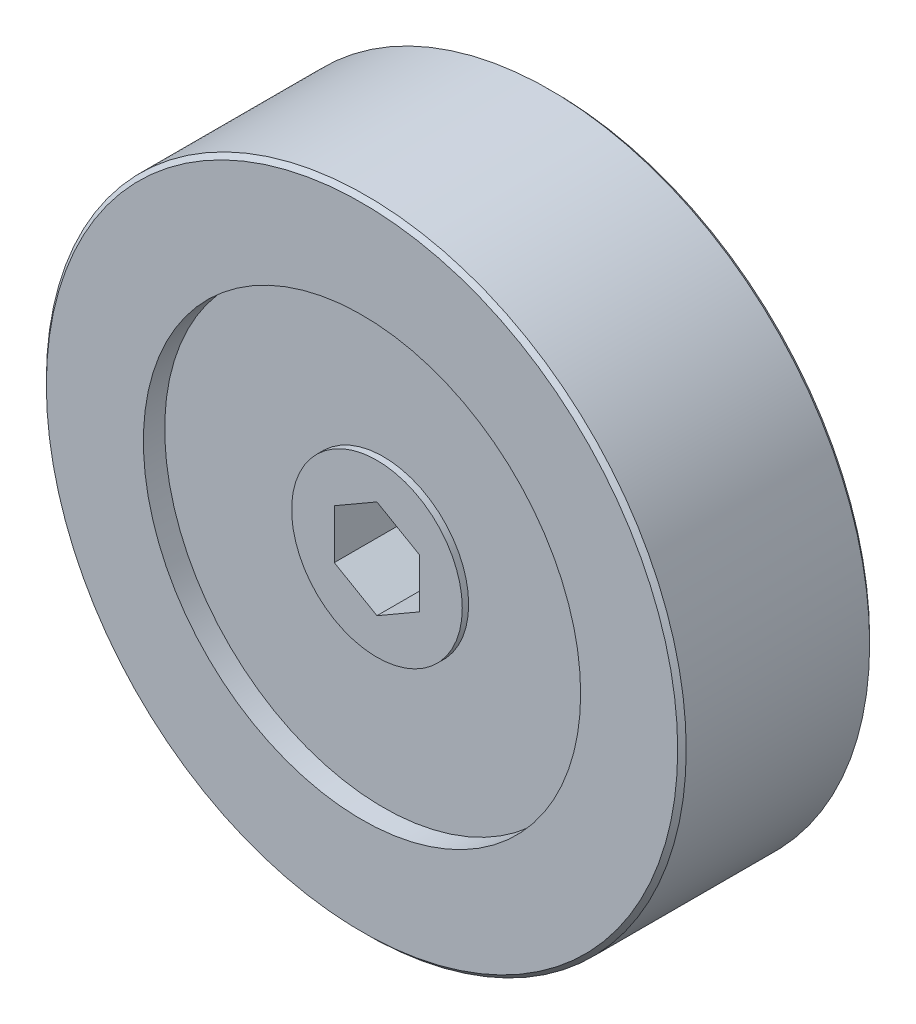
ISO-10303-21;
HEADER;
FILE_DESCRIPTION(('STEP AP214'),'2;1');
FILE_NAME('part.step','',(''),(''),'','','');
FILE_SCHEMA(('AUTOMOTIVE_DESIGN { 1 0 10303 214 1 1 1 1 }'));
ENDSEC;
DATA;
#1=APPLICATION_CONTEXT('core data for automotive mechanical design processes');
#2=APPLICATION_PROTOCOL_DEFINITION('international standard','automotive_design',2000,#1);
#3=PRODUCT_CONTEXT('',#1,'mechanical');
#4=PRODUCT('Part','Part','',(#3));
#5=PRODUCT_RELATED_PRODUCT_CATEGORY('part','',(#4));
#6=PRODUCT_DEFINITION_FORMATION('','',#4);
#7=PRODUCT_DEFINITION_CONTEXT('part definition',#1,'design');
#8=PRODUCT_DEFINITION('design','',#6,#7);
#9=PRODUCT_DEFINITION_SHAPE('','',#8);
#10=(LENGTH_UNIT() NAMED_UNIT(*) SI_UNIT(.MILLI.,.METRE.));
#11=(NAMED_UNIT(*) PLANE_ANGLE_UNIT() SI_UNIT($,.RADIAN.));
#12=(NAMED_UNIT(*) SI_UNIT($,.STERADIAN.) SOLID_ANGLE_UNIT());
#13=UNCERTAINTY_MEASURE_WITH_UNIT(LENGTH_MEASURE(1.E-05),#10,'distance_accuracy_value','');
#14=(GEOMETRIC_REPRESENTATION_CONTEXT(3) GLOBAL_UNCERTAINTY_ASSIGNED_CONTEXT((#13)) GLOBAL_UNIT_ASSIGNED_CONTEXT((#10,
#11,#12)) REPRESENTATION_CONTEXT('',''));
#15=CARTESIAN_POINT('',(0.,0.,0.));
#16=DIRECTION('',(0.,0.,1.));
#17=DIRECTION('',(1.,0.,0.));
#18=AXIS2_PLACEMENT_3D('',#15,#16,#17);
#19=CARTESIAN_POINT('',(0.,0.,1.2));
#20=DIRECTION('',(0.,0.,-1.));
#21=DIRECTION('',(-1.,0.,0.));
#22=AXIS2_PLACEMENT_3D('',#19,#20,#21);
#23=CYLINDRICAL_SURFACE('',#22,2.5);
#24=CARTESIAN_POINT('',(0.,0.,-7.1));
#25=DIRECTION('',(0.,0.,-1.));
#26=DIRECTION('',(-1.,0.,0.));
#27=AXIS2_PLACEMENT_3D('',#24,#25,#26);
#28=CIRCLE('',#27,2.5);
#29=CARTESIAN_POINT('',(-2.5,0.,-7.1));
#30=VERTEX_POINT('',#29);
#31=EDGE_CURVE('E9',#30,#30,#28,.F.);
#32=ORIENTED_EDGE('',*,*,#31,.T.);
#33=EDGE_LOOP('',(#32));
#34=FACE_BOUND('',#33,.T.);
#35=CARTESIAN_POINT('',(0.,0.,-1.1));
#36=DIRECTION('',(0.,0.,1.));
#37=DIRECTION('',(1.,0.,0.));
#38=AXIS2_PLACEMENT_3D('',#35,#36,#37);
#39=CIRCLE('',#38,2.5);
#40=CARTESIAN_POINT('',(2.5,0.,-1.1));
#41=VERTEX_POINT('',#40);
#42=EDGE_CURVE('E76',#41,#41,#39,.T.);
#43=ORIENTED_EDGE('',*,*,#42,.F.);
#44=EDGE_LOOP('',(#43));
#45=FACE_BOUND('',#44,.T.);
#46=ADVANCED_FACE('F14',(#34,#45),#23,.T.);
#47=CARTESIAN_POINT('',(0.,0.,1.2));
#48=DIRECTION('',(0.,0.,-1.));
#49=DIRECTION('',(-1.,0.,0.));
#50=AXIS2_PLACEMENT_3D('',#47,#48,#49);
#51=CYLINDRICAL_SURFACE('',#50,5.);
#52=CARTESIAN_POINT('',(0.,0.,2.));
#53=DIRECTION('',(0.,0.,-1.));
#54=DIRECTION('',(-1.,0.,0.));
#55=AXIS2_PLACEMENT_3D('',#52,#53,#54);
#56=CIRCLE('',#55,5.);
#57=CARTESIAN_POINT('',(-5.,0.,2.));
#58=VERTEX_POINT('',#57);
#59=EDGE_CURVE('E113',#58,#58,#56,.F.);
#60=ORIENTED_EDGE('',*,*,#59,.F.);
#61=EDGE_LOOP('',(#60));
#62=FACE_BOUND('',#61,.T.);
#63=CARTESIAN_POINT('',(0.,0.,0.5));
#64=DIRECTION('',(0.,0.,-1.));
#65=DIRECTION('',(-1.,0.,0.));
#66=AXIS2_PLACEMENT_3D('',#63,#64,#65);
#67=CIRCLE('',#66,5.);
#68=CARTESIAN_POINT('',(-5.,0.,0.5));
#69=VERTEX_POINT('',#68);
#70=EDGE_CURVE('E110',#69,#69,#67,.T.);
#71=ORIENTED_EDGE('',*,*,#70,.F.);
#72=EDGE_LOOP('',(#71));
#73=FACE_BOUND('',#72,.T.);
#74=ADVANCED_FACE('F155',(#62,#73),#51,.T.);
#75=CARTESIAN_POINT('',(0.,5.1,2.));
#76=DIRECTION('',(0.,0.,-1.));
#77=DIRECTION('',(-1.,0.,0.));
#78=AXIS2_PLACEMENT_3D('',#75,#76,#77);
#79=PLANE('',#78);
#80=CARTESIAN_POINT('',(0.,0.,2.));
#81=DIRECTION('',(0.,0.,1.));
#82=DIRECTION('',(1.,0.,0.));
#83=AXIS2_PLACEMENT_3D('',#80,#81,#82);
#84=CIRCLE('',#83,10.25);
#85=CARTESIAN_POINT('',(10.25,0.,2.));
#86=VERTEX_POINT('',#85);
#87=EDGE_CURVE('E128',#86,#86,#84,.T.);
#88=ORIENTED_EDGE('',*,*,#87,.F.);
#89=EDGE_LOOP('',(#88));
#90=FACE_BOUND('',#89,.T.);
#91=ORIENTED_EDGE('',*,*,#59,.T.);
#92=EDGE_LOOP('',(#91));
#93=FACE_BOUND('',#92,.T.);
#94=ADVANCED_FACE('F161',(#90,#93),#79,.T.);
#95=CARTESIAN_POINT('',(0.,0.,13.));
#96=DIRECTION('',(0.,0.,1.));
#97=DIRECTION('',(1.,0.,0.));
#98=AXIS2_PLACEMENT_3D('',#95,#96,#97);
#99=CYLINDRICAL_SURFACE('',#98,10.25);
#100=ORIENTED_EDGE('',*,*,#87,.T.);
#101=EDGE_LOOP('',(#100));
#102=FACE_BOUND('',#101,.T.);
#103=CARTESIAN_POINT('',(0.,0.,1.));
#104=DIRECTION('',(0.,0.,1.));
#105=DIRECTION('',(1.,0.,0.));
#106=AXIS2_PLACEMENT_3D('',#103,#104,#105);
#107=CIRCLE('',#106,10.25);
#108=CARTESIAN_POINT('',(10.25,0.,1.));
#109=VERTEX_POINT('',#108);
#110=EDGE_CURVE('E131',#109,#109,#107,.T.);
#111=ORIENTED_EDGE('',*,*,#110,.F.);
#112=EDGE_LOOP('',(#111));
#113=FACE_BOUND('',#112,.T.);
#114=ADVANCED_FACE('F196',(#102,#113),#99,.F.);
#115=CARTESIAN_POINT('',(0.,14.8,1.));
#116=DIRECTION('',(0.,0.,-1.));
#117=DIRECTION('',(-1.,0.,0.));
#118=AXIS2_PLACEMENT_3D('',#115,#116,#117);
#119=PLANE('',#118);
#120=ORIENTED_EDGE('',*,*,#110,.T.);
#121=EDGE_LOOP('',(#120));
#122=FACE_BOUND('',#121,.T.);
#123=CARTESIAN_POINT('',(0.,0.,1.));
#124=DIRECTION('',(0.,0.,1.));
#125=DIRECTION('',(1.,0.,0.));
#126=AXIS2_PLACEMENT_3D('',#123,#124,#125);
#127=CIRCLE('',#126,14.8);
#128=CARTESIAN_POINT('',(14.8,0.,1.));
#129=VERTEX_POINT('',#128);
#130=EDGE_CURVE('E436',#129,#129,#127,.T.);
#131=ORIENTED_EDGE('',*,*,#130,.F.);
#132=EDGE_LOOP('',(#131));
#133=FACE_BOUND('',#132,.T.);
#134=ADVANCED_FACE('F200',(#122,#133),#119,.T.);
#135=CARTESIAN_POINT('',(0.,0.,0.5));
#136=DIRECTION('',(0.,0.,-1.));
#137=DIRECTION('',(-1.,0.,0.));
#138=AXIS2_PLACEMENT_3D('',#135,#136,#137);
#139=PLANE('',#138);
#140=CARTESIAN_POINT('',(0.,0.,0.5));
#141=DIRECTION('',(0.,0.,-1.));
#142=DIRECTION('',(-1.,0.,0.));
#143=AXIS2_PLACEMENT_3D('',#140,#141,#142);
#144=CIRCLE('',#143,2.);
#145=CARTESIAN_POINT('',(-2.,0.,0.5));
#146=VERTEX_POINT('',#145);
#147=EDGE_CURVE('E107',#146,#146,#144,.T.);
#148=ORIENTED_EDGE('',*,*,#147,.F.);
#149=EDGE_LOOP('',(#148));
#150=FACE_BOUND('',#149,.T.);
#151=ORIENTED_EDGE('',*,*,#70,.T.);
#152=EDGE_LOOP('',(#151));
#153=FACE_BOUND('',#152,.T.);
#154=ADVANCED_FACE('F170',(#150,#153),#139,.T.);
#155=CARTESIAN_POINT('',(0.,0.,1.2));
#156=DIRECTION('',(0.,0.,-1.));
#157=DIRECTION('',(-1.,0.,0.));
#158=AXIS2_PLACEMENT_3D('',#155,#156,#157);
#159=CYLINDRICAL_SURFACE('',#158,2.);
#160=CARTESIAN_POINT('',(0.,0.,-1.1));
#161=DIRECTION('',(0.,0.,1.));
#162=DIRECTION('',(1.,0.,0.));
#163=AXIS2_PLACEMENT_3D('',#160,#161,#162);
#164=CIRCLE('',#163,2.);
#165=CARTESIAN_POINT('',(2.,0.,-1.1));
#166=VERTEX_POINT('',#165);
#167=EDGE_CURVE('E106',#166,#166,#164,.T.);
#168=ORIENTED_EDGE('',*,*,#167,.T.);
#169=EDGE_LOOP('',(#168));
#170=FACE_BOUND('',#169,.T.);
#171=ORIENTED_EDGE('',*,*,#147,.T.);
#172=EDGE_LOOP('',(#171));
#173=FACE_BOUND('',#172,.T.);
#174=ADVANCED_FACE('F167',(#170,#173),#159,.T.);
#175=CARTESIAN_POINT('',(0.,0.,-1.1));
#176=DIRECTION('',(0.,0.,1.));
#177=DIRECTION('',(1.,0.,0.));
#178=AXIS2_PLACEMENT_3D('',#175,#176,#177);
#179=PLANE('',#178);
#180=ORIENTED_EDGE('',*,*,#167,.F.);
#181=EDGE_LOOP('',(#180));
#182=FACE_BOUND('',#181,.T.);
#183=ORIENTED_EDGE('',*,*,#42,.T.);
#184=EDGE_LOOP('',(#183));
#185=FACE_BOUND('',#184,.T.);
#186=ADVANCED_FACE('F151',(#182,#185),#179,.T.);
#187=CARTESIAN_POINT('',(0.,0.,-7.5));
#188=DIRECTION('',(0.,0.,-1.));
#189=DIRECTION('',(-1.,0.,0.));
#190=AXIS2_PLACEMENT_3D('',#187,#188,#189);
#191=PLANE('',#190);
#192=CARTESIAN_POINT('',(0.,0.,-7.5));
#193=DIRECTION('',(0.,0.,-1.));
#194=DIRECTION('',(-1.,0.,0.));
#195=AXIS2_PLACEMENT_3D('',#192,#193,#194);
#196=CIRCLE('',#195,2.1);
#197=CARTESIAN_POINT('',(-2.1,0.,-7.5));
#198=VERTEX_POINT('',#197);
#199=EDGE_CURVE('E22',#198,#198,#196,.T.);
#200=ORIENTED_EDGE('',*,*,#199,.T.);
#201=EDGE_LOOP('',(#200));
#202=FACE_BOUND('',#201,.T.);
#203=ADVANCED_FACE('F138',(#202),#191,.T.);
#204=CARTESIAN_POINT('',(0.,0.,-7.5));
#205=DIRECTION('',(0.,0.,1.));
#206=DIRECTION('',(1.,0.,0.));
#207=AXIS2_PLACEMENT_3D('',#204,#205,#206);
#208=CONICAL_SURFACE('',#207,2.1,0.785398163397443);
#209=ORIENTED_EDGE('',*,*,#31,.F.);
#210=EDGE_LOOP('',(#209));
#211=FACE_BOUND('',#210,.T.);
#212=ORIENTED_EDGE('',*,*,#199,.F.);
#213=EDGE_LOOP('',(#212));
#214=FACE_BOUND('',#213,.T.);
#215=ADVANCED_FACE('F16',(#211,#214),#208,.T.);
#216=CARTESIAN_POINT('',(0.,0.,9.79999999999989));
#217=DIRECTION('',(0.,0.,-1.));
#218=DIRECTION('',(-1.,0.,0.));
#219=AXIS2_PLACEMENT_3D('',#216,#217,#218);
#220=CONICAL_SURFACE('',#219,15.,0.785398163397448);
#221=CARTESIAN_POINT('',(0.,0.,9.99999999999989));
#222=DIRECTION('',(0.,0.,1.));
#223=DIRECTION('',(1.,0.,0.));
#224=AXIS2_PLACEMENT_3D('',#221,#222,#223);
#225=CIRCLE('',#224,14.8);
#226=CARTESIAN_POINT('',(14.8,0.,9.99999999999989));
#227=VERTEX_POINT('',#226);
#228=EDGE_CURVE('E86',#227,#227,#225,.T.);
#229=ORIENTED_EDGE('',*,*,#228,.F.);
#230=EDGE_LOOP('',(#229));
#231=FACE_BOUND('',#230,.T.);
#232=CARTESIAN_POINT('',(0.,0.,9.79999999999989));
#233=DIRECTION('',(0.,0.,1.));
#234=DIRECTION('',(1.,0.,0.));
#235=AXIS2_PLACEMENT_3D('',#232,#233,#234);
#236=CIRCLE('',#235,15.);
#237=CARTESIAN_POINT('',(15.,0.,9.79999999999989));
#238=VERTEX_POINT('',#237);
#239=EDGE_CURVE('E218',#238,#238,#236,.T.);
#240=ORIENTED_EDGE('',*,*,#239,.T.);
#241=EDGE_LOOP('',(#240));
#242=FACE_BOUND('',#241,.T.);
#243=ADVANCED_FACE('F141',(#231,#242),#220,.T.);
#244=CARTESIAN_POINT('',(0.,0.,9.79999999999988));
#245=DIRECTION('',(0.,0.,1.));
#246=DIRECTION('',(1.,0.,0.));
#247=AXIS2_PLACEMENT_3D('',#244,#245,#246);
#248=CYLINDRICAL_SURFACE('',#247,15.);
#249=ORIENTED_EDGE('',*,*,#239,.F.);
#250=EDGE_LOOP('',(#249));
#251=FACE_BOUND('',#250,.T.);
#252=CARTESIAN_POINT('',(0.,0.,1.2));
#253=DIRECTION('',(0.,0.,1.));
#254=DIRECTION('',(1.,0.,0.));
#255=AXIS2_PLACEMENT_3D('',#252,#253,#254);
#256=CIRCLE('',#255,15.);
#257=CARTESIAN_POINT('',(15.,0.,1.2));
#258=VERTEX_POINT('',#257);
#259=EDGE_CURVE('E221',#258,#258,#256,.T.);
#260=ORIENTED_EDGE('',*,*,#259,.T.);
#261=EDGE_LOOP('',(#260));
#262=FACE_BOUND('',#261,.T.);
#263=ADVANCED_FACE('F148',(#251,#262),#248,.T.);
#264=CARTESIAN_POINT('',(0.,0.,1.));
#265=DIRECTION('',(0.,0.,1.));
#266=DIRECTION('',(1.,0.,0.));
#267=AXIS2_PLACEMENT_3D('',#264,#265,#266);
#268=CONICAL_SURFACE('',#267,14.8,0.785398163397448);
#269=ORIENTED_EDGE('',*,*,#259,.F.);
#270=EDGE_LOOP('',(#269));
#271=FACE_BOUND('',#270,.T.);
#272=ORIENTED_EDGE('',*,*,#130,.T.);
#273=EDGE_LOOP('',(#272));
#274=FACE_BOUND('',#273,.T.);
#275=ADVANCED_FACE('F176',(#271,#274),#268,.T.);
#276=CARTESIAN_POINT('',(0.,0.,5.8));
#277=DIRECTION('',(0.,0.,1.));
#278=DIRECTION('',(1.,0.,0.));
#279=AXIS2_PLACEMENT_3D('',#276,#277,#278);
#280=PLANE('',#279);
#281=DIRECTION('',(0.,-1.,0.));
#282=VECTOR('',#281,1.);
#283=CARTESIAN_POINT('',(-2.,1.15470053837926,5.8));
#284=LINE('',#283,#282);
#285=CARTESIAN_POINT('',(-2.,1.15470053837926,5.8));
#286=VERTEX_POINT('',#285);
#287=CARTESIAN_POINT('',(-2.,-1.15470053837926,5.8));
#288=VERTEX_POINT('',#287);
#289=EDGE_CURVE('E89',#286,#288,#284,.T.);
#290=ORIENTED_EDGE('',*,*,#289,.T.);
#291=DIRECTION('',(0.866025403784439,-0.5,0.));
#292=VECTOR('',#291,1.);
#293=CARTESIAN_POINT('',(-2.,-1.15470053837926,5.8));
#294=LINE('',#293,#292);
#295=CARTESIAN_POINT('',(0.,-2.30940107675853,5.8));
#296=VERTEX_POINT('',#295);
#297=EDGE_CURVE('E233',#288,#296,#294,.T.);
#298=ORIENTED_EDGE('',*,*,#297,.T.);
#299=DIRECTION('',(0.866025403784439,0.5,0.));
#300=VECTOR('',#299,1.);
#301=CARTESIAN_POINT('',(0.,-2.30940107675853,5.8));
#302=LINE('',#301,#300);
#303=CARTESIAN_POINT('',(2.,-1.15470053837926,5.8));
#304=VERTEX_POINT('',#303);
#305=EDGE_CURVE('E235',#296,#304,#302,.T.);
#306=ORIENTED_EDGE('',*,*,#305,.T.);
#307=DIRECTION('',(0.,1.,0.));
#308=VECTOR('',#307,1.);
#309=CARTESIAN_POINT('',(2.,-1.15470053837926,5.8));
#310=LINE('',#309,#308);
#311=CARTESIAN_POINT('',(2.,1.15470053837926,5.8));
#312=VERTEX_POINT('',#311);
#313=EDGE_CURVE('E237',#304,#312,#310,.T.);
#314=ORIENTED_EDGE('',*,*,#313,.T.);
#315=DIRECTION('',(-0.866025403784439,0.5,0.));
#316=VECTOR('',#315,1.);
#317=CARTESIAN_POINT('',(2.,1.15470053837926,5.8));
#318=LINE('',#317,#316);
#319=CARTESIAN_POINT('',(0.,2.30940107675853,5.8));
#320=VERTEX_POINT('',#319);
#321=EDGE_CURVE('E34',#312,#320,#318,.T.);
#322=ORIENTED_EDGE('',*,*,#321,.T.);
#323=DIRECTION('',(-0.866025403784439,-0.5,0.));
#324=VECTOR('',#323,1.);
#325=CARTESIAN_POINT('',(0.,2.30940107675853,5.8));
#326=LINE('',#325,#324);
#327=EDGE_CURVE('E29',#320,#286,#326,.T.);
#328=ORIENTED_EDGE('',*,*,#327,.T.);
#329=EDGE_LOOP('',(#290,#298,#306,#314,#322,#328));
#330=FACE_BOUND('',#329,.T.);
#331=ADVANCED_FACE('F172',(#330),#280,.T.);
#332=CARTESIAN_POINT('',(0.,-2.30940107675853,16.9376261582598));
#333=DIRECTION('',(-0.5,0.866025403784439,0.));
#334=DIRECTION('',(-0.866025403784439,-0.5,0.));
#335=AXIS2_PLACEMENT_3D('',#332,#333,#334);
#336=PLANE('',#335);
#337=DIRECTION('',(0.,0.,-1.));
#338=VECTOR('',#337,1.);
#339=CARTESIAN_POINT('',(0.,-2.30940107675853,16.9376261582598));
#340=LINE('',#339,#338);
#341=CARTESIAN_POINT('',(0.,-2.30940107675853,9.3));
#342=VERTEX_POINT('',#341);
#343=EDGE_CURVE('E77',#342,#296,#340,.T.);
#344=ORIENTED_EDGE('',*,*,#343,.F.);
#345=DIRECTION('',(0.866025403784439,0.5,0.));
#346=VECTOR('',#345,1.);
#347=CARTESIAN_POINT('',(0.,-2.30940107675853,9.3));
#348=LINE('',#347,#346);
#349=CARTESIAN_POINT('',(2.,-1.15470053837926,9.3));
#350=VERTEX_POINT('',#349);
#351=EDGE_CURVE('E229',#342,#350,#348,.T.);
#352=ORIENTED_EDGE('',*,*,#351,.T.);
#353=DIRECTION('',(0.,0.,-1.));
#354=VECTOR('',#353,1.);
#355=CARTESIAN_POINT('',(2.,-1.15470053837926,16.9376261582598));
#356=LINE('',#355,#354);
#357=EDGE_CURVE('E99',#350,#304,#356,.T.);
#358=ORIENTED_EDGE('',*,*,#357,.T.);
#359=ORIENTED_EDGE('',*,*,#305,.F.);
#360=EDGE_LOOP('',(#344,#352,#358,#359));
#361=FACE_BOUND('',#360,.T.);
#362=ADVANCED_FACE('F175',(#361),#336,.T.);
#363=CARTESIAN_POINT('',(2.,-1.15470053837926,16.9376261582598));
#364=DIRECTION('',(-1.,0.,0.));
#365=DIRECTION('',(0.,-1.,0.));
#366=AXIS2_PLACEMENT_3D('',#363,#364,#365);
#367=PLANE('',#366);
#368=ORIENTED_EDGE('',*,*,#357,.F.);
#369=DIRECTION('',(0.,1.,0.));
#370=VECTOR('',#369,1.);
#371=CARTESIAN_POINT('',(2.,-1.15470053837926,9.3));
#372=LINE('',#371,#370);
#373=CARTESIAN_POINT('',(2.,1.15470053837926,9.3));
#374=VERTEX_POINT('',#373);
#375=EDGE_CURVE('E226',#350,#374,#372,.T.);
#376=ORIENTED_EDGE('',*,*,#375,.T.);
#377=DIRECTION('',(0.,0.,-1.));
#378=VECTOR('',#377,1.);
#379=CARTESIAN_POINT('',(2.,1.15470053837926,16.9376261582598));
#380=LINE('',#379,#378);
#381=EDGE_CURVE('E92',#374,#312,#380,.T.);
#382=ORIENTED_EDGE('',*,*,#381,.T.);
#383=ORIENTED_EDGE('',*,*,#313,.F.);
#384=EDGE_LOOP('',(#368,#376,#382,#383));
#385=FACE_BOUND('',#384,.T.);
#386=ADVANCED_FACE('F249',(#385),#367,.T.);
#387=CARTESIAN_POINT('',(2.,1.15470053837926,16.9376261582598));
#388=DIRECTION('',(-0.5,-0.866025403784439,0.));
#389=DIRECTION('',(0.866025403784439,-0.5,0.));
#390=AXIS2_PLACEMENT_3D('',#387,#388,#389);
#391=PLANE('',#390);
#392=ORIENTED_EDGE('',*,*,#381,.F.);
#393=DIRECTION('',(-0.866025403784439,0.5,0.));
#394=VECTOR('',#393,1.);
#395=CARTESIAN_POINT('',(2.,1.15470053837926,9.3));
#396=LINE('',#395,#394);
#397=CARTESIAN_POINT('',(0.,2.30940107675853,9.3));
#398=VERTEX_POINT('',#397);
#399=EDGE_CURVE('E85',#374,#398,#396,.T.);
#400=ORIENTED_EDGE('',*,*,#399,.T.);
#401=DIRECTION('',(0.,0.,-1.));
#402=VECTOR('',#401,1.);
#403=CARTESIAN_POINT('',(0.,2.30940107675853,16.9376261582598));
#404=LINE('',#403,#402);
#405=EDGE_CURVE('E83',#398,#320,#404,.T.);
#406=ORIENTED_EDGE('',*,*,#405,.T.);
#407=ORIENTED_EDGE('',*,*,#321,.F.);
#408=EDGE_LOOP('',(#392,#400,#406,#407));
#409=FACE_BOUND('',#408,.T.);
#410=ADVANCED_FACE('F251',(#409),#391,.T.);
#411=CARTESIAN_POINT('',(0.,2.30940107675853,16.9376261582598));
#412=DIRECTION('',(0.5,-0.866025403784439,0.));
#413=DIRECTION('',(0.866025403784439,0.5,0.));
#414=AXIS2_PLACEMENT_3D('',#411,#412,#413);
#415=PLANE('',#414);
#416=ORIENTED_EDGE('',*,*,#405,.F.);
#417=DIRECTION('',(-0.866025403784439,-0.5,0.));
#418=VECTOR('',#417,1.);
#419=CARTESIAN_POINT('',(0.,2.30940107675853,9.3));
#420=LINE('',#419,#418);
#421=CARTESIAN_POINT('',(-2.,1.15470053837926,9.3));
#422=VERTEX_POINT('',#421);
#423=EDGE_CURVE('E68',#398,#422,#420,.T.);
#424=ORIENTED_EDGE('',*,*,#423,.T.);
#425=DIRECTION('',(0.,0.,-1.));
#426=VECTOR('',#425,1.);
#427=CARTESIAN_POINT('',(-2.,1.15470053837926,16.9376261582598));
#428=LINE('',#427,#426);
#429=EDGE_CURVE('E81',#422,#286,#428,.T.);
#430=ORIENTED_EDGE('',*,*,#429,.T.);
#431=ORIENTED_EDGE('',*,*,#327,.F.);
#432=EDGE_LOOP('',(#416,#424,#430,#431));
#433=FACE_BOUND('',#432,.T.);
#434=ADVANCED_FACE('F80',(#433),#415,.T.);
#435=CARTESIAN_POINT('',(-2.,1.15470053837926,16.9376261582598));
#436=DIRECTION('',(1.,0.,0.));
#437=DIRECTION('',(0.,0.,-1.));
#438=AXIS2_PLACEMENT_3D('',#435,#436,#437);
#439=PLANE('',#438);
#440=ORIENTED_EDGE('',*,*,#429,.F.);
#441=DIRECTION('',(0.,-1.,0.));
#442=VECTOR('',#441,1.);
#443=CARTESIAN_POINT('',(-2.,1.15470053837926,9.3));
#444=LINE('',#443,#442);
#445=CARTESIAN_POINT('',(-2.,-1.15470053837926,9.3));
#446=VERTEX_POINT('',#445);
#447=EDGE_CURVE('E65',#422,#446,#444,.T.);
#448=ORIENTED_EDGE('',*,*,#447,.T.);
#449=DIRECTION('',(0.,0.,-1.));
#450=VECTOR('',#449,1.);
#451=CARTESIAN_POINT('',(-2.,-1.15470053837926,16.9376261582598));
#452=LINE('',#451,#450);
#453=EDGE_CURVE('E90',#446,#288,#452,.T.);
#454=ORIENTED_EDGE('',*,*,#453,.T.);
#455=ORIENTED_EDGE('',*,*,#289,.F.);
#456=EDGE_LOOP('',(#440,#448,#454,#455));
#457=FACE_BOUND('',#456,.T.);
#458=ADVANCED_FACE('F88',(#457),#439,.T.);
#459=CARTESIAN_POINT('',(-2.,-1.15470053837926,16.9376261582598));
#460=DIRECTION('',(0.5,0.866025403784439,0.));
#461=DIRECTION('',(-0.866025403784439,0.5,0.));
#462=AXIS2_PLACEMENT_3D('',#459,#460,#461);
#463=PLANE('',#462);
#464=ORIENTED_EDGE('',*,*,#453,.F.);
#465=DIRECTION('',(0.866025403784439,-0.5,0.));
#466=VECTOR('',#465,1.);
#467=CARTESIAN_POINT('',(-2.,-1.15470053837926,9.3));
#468=LINE('',#467,#466);
#469=EDGE_CURVE('E71',#446,#342,#468,.T.);
#470=ORIENTED_EDGE('',*,*,#469,.T.);
#471=ORIENTED_EDGE('',*,*,#343,.T.);
#472=ORIENTED_EDGE('',*,*,#297,.F.);
#473=EDGE_LOOP('',(#464,#470,#471,#472));
#474=FACE_BOUND('',#473,.T.);
#475=ADVANCED_FACE('F192',(#474),#463,.T.);
#476=CARTESIAN_POINT('',(0.,4.00000000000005,9.3));
#477=DIRECTION('',(0.,0.,1.));
#478=DIRECTION('',(1.,0.,0.));
#479=AXIS2_PLACEMENT_3D('',#476,#477,#478);
#480=PLANE('',#479);
#481=CARTESIAN_POINT('',(0.,0.,9.3));
#482=DIRECTION('',(0.,0.,1.));
#483=DIRECTION('',(1.,0.,0.));
#484=AXIS2_PLACEMENT_3D('',#481,#482,#483);
#485=CIRCLE('',#484,4.00000000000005);
#486=CARTESIAN_POINT('',(4.00000000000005,0.,9.3));
#487=VERTEX_POINT('',#486);
#488=EDGE_CURVE('E125',#487,#487,#485,.T.);
#489=ORIENTED_EDGE('',*,*,#488,.T.);
#490=EDGE_LOOP('',(#489));
#491=FACE_BOUND('',#490,.T.);
#492=ORIENTED_EDGE('',*,*,#469,.F.);
#493=ORIENTED_EDGE('',*,*,#447,.F.);
#494=ORIENTED_EDGE('',*,*,#423,.F.);
#495=ORIENTED_EDGE('',*,*,#399,.F.);
#496=ORIENTED_EDGE('',*,*,#375,.F.);
#497=ORIENTED_EDGE('',*,*,#351,.F.);
#498=EDGE_LOOP('',(#492,#493,#494,#495,#496,#497));
#499=FACE_BOUND('',#498,.T.);
#500=ADVANCED_FACE('F67',(#491,#499),#480,.T.);
#501=CARTESIAN_POINT('',(0.,0.,13.));
#502=DIRECTION('',(0.,0.,1.));
#503=DIRECTION('',(1.,0.,0.));
#504=AXIS2_PLACEMENT_3D('',#501,#502,#503);
#505=CYLINDRICAL_SURFACE('',#504,4.00000000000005);
#506=CARTESIAN_POINT('',(0.,0.,9.));
#507=DIRECTION('',(0.,0.,1.));
#508=DIRECTION('',(1.,0.,0.));
#509=AXIS2_PLACEMENT_3D('',#506,#507,#508);
#510=CIRCLE('',#509,4.00000000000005);
#511=CARTESIAN_POINT('',(4.00000000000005,0.,9.));
#512=VERTEX_POINT('',#511);
#513=EDGE_CURVE('E122',#512,#512,#510,.T.);
#514=ORIENTED_EDGE('',*,*,#513,.T.);
#515=EDGE_LOOP('',(#514));
#516=FACE_BOUND('',#515,.T.);
#517=ORIENTED_EDGE('',*,*,#488,.F.);
#518=EDGE_LOOP('',(#517));
#519=FACE_BOUND('',#518,.T.);
#520=ADVANCED_FACE('F185',(#516,#519),#505,.T.);
#521=CARTESIAN_POINT('',(0.,10.25,9.));
#522=DIRECTION('',(0.,0.,1.));
#523=DIRECTION('',(1.,0.,0.));
#524=AXIS2_PLACEMENT_3D('',#521,#522,#523);
#525=PLANE('',#524);
#526=CARTESIAN_POINT('',(0.,0.,9.));
#527=DIRECTION('',(0.,0.,1.));
#528=DIRECTION('',(1.,0.,0.));
#529=AXIS2_PLACEMENT_3D('',#526,#527,#528);
#530=CIRCLE('',#529,10.25);
#531=CARTESIAN_POINT('',(10.25,0.,9.));
#532=VERTEX_POINT('',#531);
#533=EDGE_CURVE('E119',#532,#532,#530,.T.);
#534=ORIENTED_EDGE('',*,*,#533,.T.);
#535=EDGE_LOOP('',(#534));
#536=FACE_BOUND('',#535,.T.);
#537=ORIENTED_EDGE('',*,*,#513,.F.);
#538=EDGE_LOOP('',(#537));
#539=FACE_BOUND('',#538,.T.);
#540=ADVANCED_FACE('F181',(#536,#539),#525,.T.);
#541=CARTESIAN_POINT('',(0.,0.,13.));
#542=DIRECTION('',(0.,0.,1.));
#543=DIRECTION('',(1.,0.,0.));
#544=AXIS2_PLACEMENT_3D('',#541,#542,#543);
#545=CYLINDRICAL_SURFACE('',#544,10.25);
#546=CARTESIAN_POINT('',(0.,0.,10.));
#547=DIRECTION('',(0.,0.,1.));
#548=DIRECTION('',(1.,0.,0.));
#549=AXIS2_PLACEMENT_3D('',#546,#547,#548);
#550=CIRCLE('',#549,10.25);
#551=CARTESIAN_POINT('',(10.25,0.,10.));
#552=VERTEX_POINT('',#551);
#553=EDGE_CURVE('E116',#552,#552,#550,.T.);
#554=ORIENTED_EDGE('',*,*,#553,.T.);
#555=EDGE_LOOP('',(#554));
#556=FACE_BOUND('',#555,.T.);
#557=ORIENTED_EDGE('',*,*,#533,.F.);
#558=EDGE_LOOP('',(#557));
#559=FACE_BOUND('',#558,.T.);
#560=ADVANCED_FACE('F177',(#556,#559),#545,.F.);
#561=CARTESIAN_POINT('',(0.,14.8,10.));
#562=DIRECTION('',(0.,0.,1.));
#563=DIRECTION('',(1.,0.,0.));
#564=AXIS2_PLACEMENT_3D('',#561,#562,#563);
#565=PLANE('',#564);
#566=ORIENTED_EDGE('',*,*,#228,.T.);
#567=EDGE_LOOP('',(#566));
#568=FACE_BOUND('',#567,.T.);
#569=ORIENTED_EDGE('',*,*,#553,.F.);
#570=EDGE_LOOP('',(#569));
#571=FACE_BOUND('',#570,.T.);
#572=ADVANCED_FACE('F180',(#568,#571),#565,.T.);
#573=CLOSED_SHELL('',(#46,#74,#94,#114,#134,#154,#174,#186,#203,#215,#243,#263,#275,#331,#362,
#386,#410,#434,#458,#475,#500,#520,#540,#560,#572));
#574=MANIFOLD_SOLID_BREP('B1',#573);
#575=ADVANCED_BREP_SHAPE_REPRESENTATION('',(#18,#574),#14);
#576=SHAPE_DEFINITION_REPRESENTATION(#9,#575);
ENDSEC;
END-ISO-10303-21;
